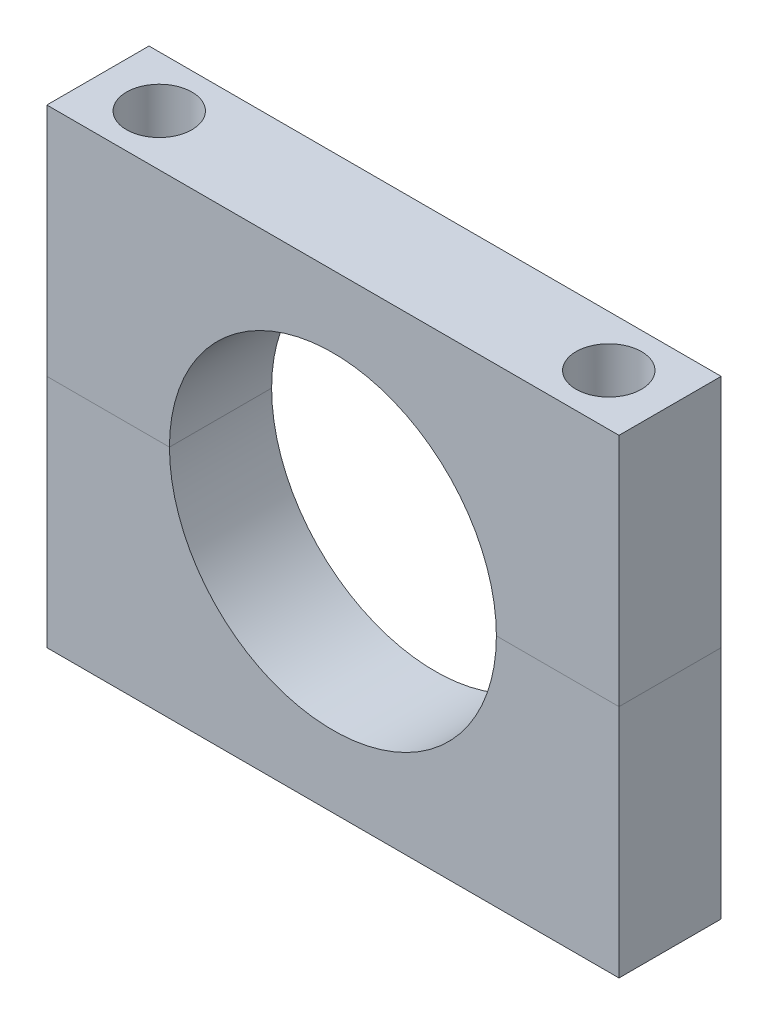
from build123d import *

# Parameters (mm, degrees)
SKETCH_1_W          = 28
SKETCH_1_H          = 23
SKETCH_1_R          = 8
EXTRUDE_1_DEPTH     = 5
SKETCH_2_R          = 1.6
CUT_EXTRUDE_1_DEPTH = 28.386127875


with BuildPart() as part:
    # Sketch 1 → Extrude 1 (new body)
    with BuildSketch(Plane.XY):
        Rectangle(SKETCH_1_W, SKETCH_1_H)
        Circle(SKETCH_1_R, mode=Mode.SUBTRACT)
    extrude(amount=EXTRUDE_1_DEPTH)

    # Sketch 2 → Cut-Extrude 1 (cut, through all)
    with BuildSketch(Plane(origin=(0, 11.5, 0), x_dir=(1, 0, 0), z_dir=(0, 1, 0))):
        with Locations(Location((-11, -2.5, 0), (0, 0, 270))):
            Circle(SKETCH_2_R)
        with Locations(Location((11, -2.5, 0), (0, 0, 90))):
            Circle(SKETCH_2_R)
    extrude(amount=-CUT_EXTRUDE_1_DEPTH, mode=Mode.SUBTRACT)


with BuildPart() as body_2:
    # Split Bodies 1: the piece on the far side of the plane
    add(part.part)
    split(bisect_by=Plane.ZX, keep=Keep.BOTTOM)


with BuildPart() as part_1:
    add(part.part)

    # Split Bodies 1
    split(bisect_by=Plane.ZX, keep=Keep.TOP)


solid = Compound([body_2.part, part_1.part])
